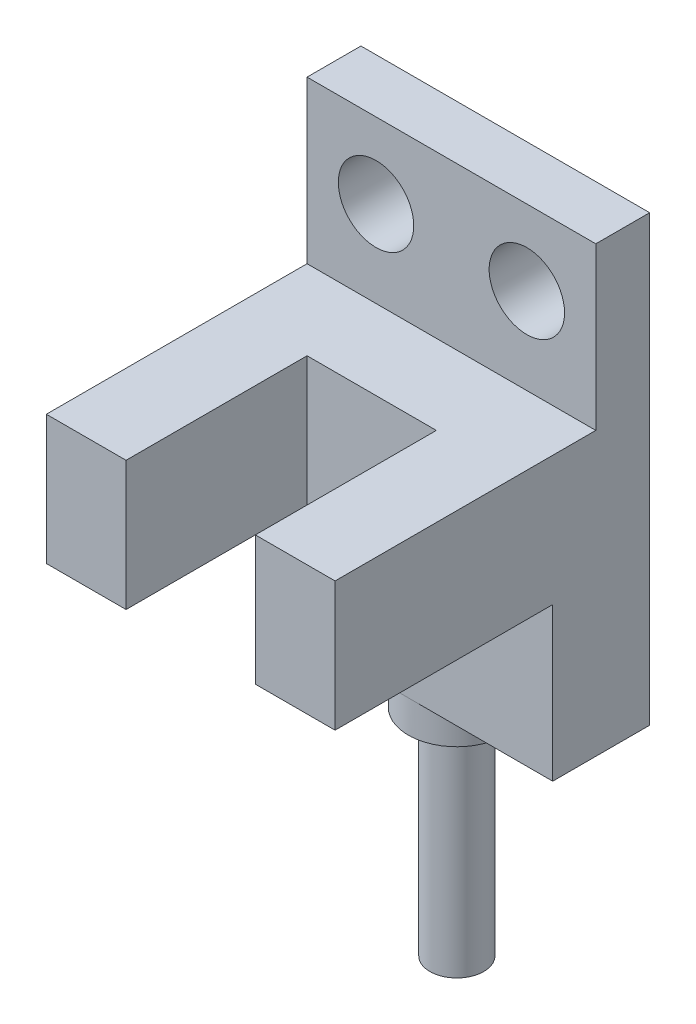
ISO-10303-21;
HEADER;
FILE_DESCRIPTION(('STEP AP214'),'2;1');
FILE_NAME('part.step','',(''),(''),'','','');
FILE_SCHEMA(('AUTOMOTIVE_DESIGN { 1 0 10303 214 1 1 1 1 }'));
ENDSEC;
DATA;
#1=APPLICATION_CONTEXT('core data for automotive mechanical design processes');
#2=APPLICATION_PROTOCOL_DEFINITION('international standard','automotive_design',2000,#1);
#3=PRODUCT_CONTEXT('',#1,'mechanical');
#4=PRODUCT('Part','Part','',(#3));
#5=PRODUCT_RELATED_PRODUCT_CATEGORY('part','',(#4));
#6=PRODUCT_DEFINITION_FORMATION('','',#4);
#7=PRODUCT_DEFINITION_CONTEXT('part definition',#1,'design');
#8=PRODUCT_DEFINITION('design','',#6,#7);
#9=PRODUCT_DEFINITION_SHAPE('','',#8);
#10=(LENGTH_UNIT() NAMED_UNIT(*) SI_UNIT(.MILLI.,.METRE.));
#11=(NAMED_UNIT(*) PLANE_ANGLE_UNIT() SI_UNIT($,.RADIAN.));
#12=(NAMED_UNIT(*) SI_UNIT($,.STERADIAN.) SOLID_ANGLE_UNIT());
#13=UNCERTAINTY_MEASURE_WITH_UNIT(LENGTH_MEASURE(1.E-05),#10,'distance_accuracy_value','');
#14=(GEOMETRIC_REPRESENTATION_CONTEXT(3) GLOBAL_UNCERTAINTY_ASSIGNED_CONTEXT((#13)) GLOBAL_UNIT_ASSIGNED_CONTEXT((#10,
#11,#12)) REPRESENTATION_CONTEXT('',''));
#15=CARTESIAN_POINT('',(0.,0.,0.));
#16=DIRECTION('',(0.,0.,1.));
#17=DIRECTION('',(1.,0.,0.));
#18=AXIS2_PLACEMENT_3D('',#15,#16,#17);
#19=CARTESIAN_POINT('',(13.4,0.,4.5));
#20=DIRECTION('',(0.,1.,0.));
#21=DIRECTION('',(0.,0.,1.));
#22=AXIS2_PLACEMENT_3D('',#19,#20,#21);
#23=PLANE('',#22);
#24=CARTESIAN_POINT('',(6.7,0.,2.25));
#25=DIRECTION('',(0.,-1.,0.));
#26=DIRECTION('',(0.,0.,-1.));
#27=AXIS2_PLACEMENT_3D('',#24,#25,#26);
#28=CIRCLE('',#27,2.25);
#29=CARTESIAN_POINT('',(6.7,0.,0.));
#30=VERTEX_POINT('',#29);
#31=CARTESIAN_POINT('',(6.7,0.,4.5));
#32=VERTEX_POINT('',#31);
#33=EDGE_CURVE('E45',#30,#32,#28,.T.);
#34=ORIENTED_EDGE('',*,*,#33,.F.);
#35=DIRECTION('',(1.,0.,0.));
#36=VECTOR('',#35,1.);
#37=CARTESIAN_POINT('',(13.4,0.,0.));
#38=LINE('',#37,#36);
#39=CARTESIAN_POINT('',(13.4,0.,0.));
#40=VERTEX_POINT('',#39);
#41=EDGE_CURVE('E138',#30,#40,#38,.T.);
#42=ORIENTED_EDGE('',*,*,#41,.T.);
#43=DIRECTION('',(0.,0.,-1.));
#44=VECTOR('',#43,1.);
#45=CARTESIAN_POINT('',(13.4,0.,4.5));
#46=LINE('',#45,#44);
#47=CARTESIAN_POINT('',(13.4,0.,4.5));
#48=VERTEX_POINT('',#47);
#49=EDGE_CURVE('E39',#48,#40,#46,.T.);
#50=ORIENTED_EDGE('',*,*,#49,.F.);
#51=DIRECTION('',(1.,0.,0.));
#52=VECTOR('',#51,1.);
#53=CARTESIAN_POINT('',(13.4,0.,4.5));
#54=LINE('',#53,#52);
#55=EDGE_CURVE('E150',#32,#48,#54,.T.);
#56=ORIENTED_EDGE('',*,*,#55,.F.);
#57=EDGE_LOOP('',(#34,#42,#50,#56));
#58=FACE_BOUND('',#57,.T.);
#59=ADVANCED_FACE('F35',(#58),#23,.F.);
#60=CARTESIAN_POINT('',(0.,0.,4.5));
#61=DIRECTION('',(0.,0.,-1.));
#62=DIRECTION('',(-1.,0.,0.));
#63=AXIS2_PLACEMENT_3D('',#60,#61,#62);
#64=PLANE('',#63);
#65=DIRECTION('',(0.,1.,0.));
#66=VECTOR('',#65,1.);
#67=CARTESIAN_POINT('',(13.4,20.6,4.5));
#68=LINE('',#67,#66);
#69=CARTESIAN_POINT('',(13.4,7.1,4.5));
#70=VERTEX_POINT('',#69);
#71=EDGE_CURVE('E303',#48,#70,#68,.T.);
#72=ORIENTED_EDGE('',*,*,#71,.T.);
#73=DIRECTION('',(1.,0.,0.));
#74=VECTOR('',#73,1.);
#75=CARTESIAN_POINT('',(3.7,7.1,4.5));
#76=LINE('',#75,#74);
#77=CARTESIAN_POINT('',(0.,7.1,4.5));
#78=VERTEX_POINT('',#77);
#79=EDGE_CURVE('E58',#78,#70,#76,.T.);
#80=ORIENTED_EDGE('',*,*,#79,.F.);
#81=DIRECTION('',(0.,-1.,0.));
#82=VECTOR('',#81,1.);
#83=CARTESIAN_POINT('',(0.,0.,4.5));
#84=LINE('',#83,#82);
#85=CARTESIAN_POINT('',(0.,0.,4.5));
#86=VERTEX_POINT('',#85);
#87=EDGE_CURVE('E305',#78,#86,#84,.T.);
#88=ORIENTED_EDGE('',*,*,#87,.T.);
#89=EDGE_CURVE('E301',#86,#32,#54,.T.);
#90=ORIENTED_EDGE('',*,*,#89,.T.);
#91=ORIENTED_EDGE('',*,*,#55,.T.);
#92=EDGE_LOOP('',(#72,#80,#88,#90,#91));
#93=FACE_BOUND('',#92,.T.);
#94=ADVANCED_FACE('F173',(#93),#64,.F.);
#95=CARTESIAN_POINT('',(3.7,13.1,14.6));
#96=DIRECTION('',(-1.,0.,0.));
#97=DIRECTION('',(0.,0.,1.));
#98=AXIS2_PLACEMENT_3D('',#95,#96,#97);
#99=PLANE('',#98);
#100=DIRECTION('',(0.,-1.,0.));
#101=VECTOR('',#100,1.);
#102=CARTESIAN_POINT('',(3.7,7.1,6.2));
#103=LINE('',#102,#101);
#104=CARTESIAN_POINT('',(3.7,13.1,6.2));
#105=VERTEX_POINT('',#104);
#106=CARTESIAN_POINT('',(3.7,7.1,6.2));
#107=VERTEX_POINT('',#106);
#108=EDGE_CURVE('E333',#105,#107,#103,.T.);
#109=ORIENTED_EDGE('',*,*,#108,.F.);
#110=DIRECTION('',(0.,0.,-1.));
#111=VECTOR('',#110,1.);
#112=CARTESIAN_POINT('',(3.7,13.1,14.6));
#113=LINE('',#112,#111);
#114=CARTESIAN_POINT('',(3.7,13.1,14.6));
#115=VERTEX_POINT('',#114);
#116=EDGE_CURVE('E267',#115,#105,#113,.T.);
#117=ORIENTED_EDGE('',*,*,#116,.F.);
#118=DIRECTION('',(0.,1.,0.));
#119=VECTOR('',#118,1.);
#120=CARTESIAN_POINT('',(3.7,13.1,14.6));
#121=LINE('',#120,#119);
#122=CARTESIAN_POINT('',(3.7,7.1,14.6));
#123=VERTEX_POINT('',#122);
#124=EDGE_CURVE('E266',#123,#115,#121,.T.);
#125=ORIENTED_EDGE('',*,*,#124,.F.);
#126=DIRECTION('',(0.,0.,-1.));
#127=VECTOR('',#126,1.);
#128=CARTESIAN_POINT('',(3.7,7.1,14.6));
#129=LINE('',#128,#127);
#130=EDGE_CURVE('E270',#123,#107,#129,.T.);
#131=ORIENTED_EDGE('',*,*,#130,.T.);
#132=EDGE_LOOP('',(#109,#117,#125,#131));
#133=FACE_BOUND('',#132,.T.);
#134=ADVANCED_FACE('F177',(#133),#99,.F.);
#135=CARTESIAN_POINT('',(9.7,13.1,14.6));
#136=DIRECTION('',(1.,0.,0.));
#137=DIRECTION('',(0.,0.,-1.));
#138=AXIS2_PLACEMENT_3D('',#135,#136,#137);
#139=PLANE('',#138);
#140=DIRECTION('',(0.,1.,0.));
#141=VECTOR('',#140,1.);
#142=CARTESIAN_POINT('',(9.7,13.1,6.2));
#143=LINE('',#142,#141);
#144=CARTESIAN_POINT('',(9.7,7.1,6.2));
#145=VERTEX_POINT('',#144);
#146=CARTESIAN_POINT('',(9.7,13.1,6.2));
#147=VERTEX_POINT('',#146);
#148=EDGE_CURVE('E336',#145,#147,#143,.T.);
#149=ORIENTED_EDGE('',*,*,#148,.F.);
#150=DIRECTION('',(0.,0.,-1.));
#151=VECTOR('',#150,1.);
#152=CARTESIAN_POINT('',(9.7,7.1,14.6));
#153=LINE('',#152,#151);
#154=CARTESIAN_POINT('',(9.7,7.1,14.6));
#155=VERTEX_POINT('',#154);
#156=EDGE_CURVE('E251',#155,#145,#153,.T.);
#157=ORIENTED_EDGE('',*,*,#156,.F.);
#158=DIRECTION('',(0.,-1.,0.));
#159=VECTOR('',#158,1.);
#160=CARTESIAN_POINT('',(9.7,13.1,14.6));
#161=LINE('',#160,#159);
#162=CARTESIAN_POINT('',(9.7,13.1,14.6));
#163=VERTEX_POINT('',#162);
#164=EDGE_CURVE('E240',#163,#155,#161,.T.);
#165=ORIENTED_EDGE('',*,*,#164,.F.);
#166=DIRECTION('',(0.,0.,-1.));
#167=VECTOR('',#166,1.);
#168=CARTESIAN_POINT('',(9.7,13.1,14.6));
#169=LINE('',#168,#167);
#170=EDGE_CURVE('E248',#163,#147,#169,.T.);
#171=ORIENTED_EDGE('',*,*,#170,.T.);
#172=EDGE_LOOP('',(#149,#157,#165,#171));
#173=FACE_BOUND('',#172,.T.);
#174=ADVANCED_FACE('F195',(#173),#139,.F.);
#175=CARTESIAN_POINT('',(13.4,20.6,4.5));
#176=DIRECTION('',(-1.,0.,0.));
#177=DIRECTION('',(0.,0.,1.));
#178=AXIS2_PLACEMENT_3D('',#175,#176,#177);
#179=PLANE('',#178);
#180=DIRECTION('',(0.,0.,1.));
#181=VECTOR('',#180,1.);
#182=CARTESIAN_POINT('',(13.4,13.1,2.5));
#183=LINE('',#182,#181);
#184=CARTESIAN_POINT('',(13.4,13.1,2.5));
#185=VERTEX_POINT('',#184);
#186=CARTESIAN_POINT('',(13.4,13.1,14.6));
#187=VERTEX_POINT('',#186);
#188=EDGE_CURVE('E148',#185,#187,#183,.T.);
#189=ORIENTED_EDGE('',*,*,#188,.T.);
#190=DIRECTION('',(0.,1.,0.));
#191=VECTOR('',#190,1.);
#192=CARTESIAN_POINT('',(13.4,13.1,14.6));
#193=LINE('',#192,#191);
#194=CARTESIAN_POINT('',(13.4,7.1,14.6));
#195=VERTEX_POINT('',#194);
#196=EDGE_CURVE('E243',#195,#187,#193,.T.);
#197=ORIENTED_EDGE('',*,*,#196,.F.);
#198=DIRECTION('',(0.,0.,-1.));
#199=VECTOR('',#198,1.);
#200=CARTESIAN_POINT('',(13.4,7.1,14.6));
#201=LINE('',#200,#199);
#202=EDGE_CURVE('E256',#195,#70,#201,.T.);
#203=ORIENTED_EDGE('',*,*,#202,.T.);
#204=ORIENTED_EDGE('',*,*,#71,.F.);
#205=ORIENTED_EDGE('',*,*,#49,.T.);
#206=DIRECTION('',(0.,1.,0.));
#207=VECTOR('',#206,1.);
#208=CARTESIAN_POINT('',(13.4,20.6,0.));
#209=LINE('',#208,#207);
#210=CARTESIAN_POINT('',(13.4,20.6,0.));
#211=VERTEX_POINT('',#210);
#212=EDGE_CURVE('E137',#40,#211,#209,.T.);
#213=ORIENTED_EDGE('',*,*,#212,.T.);
#214=DIRECTION('',(0.,0.,-1.));
#215=VECTOR('',#214,1.);
#216=CARTESIAN_POINT('',(13.4,20.6,4.5));
#217=LINE('',#216,#215);
#218=CARTESIAN_POINT('',(13.4,20.6,2.5));
#219=VERTEX_POINT('',#218);
#220=EDGE_CURVE('E315',#219,#211,#217,.T.);
#221=ORIENTED_EDGE('',*,*,#220,.F.);
#222=DIRECTION('',(0.,-1.,0.));
#223=VECTOR('',#222,1.);
#224=CARTESIAN_POINT('',(13.4,20.6,2.5));
#225=LINE('',#224,#223);
#226=EDGE_CURVE('E293',#219,#185,#225,.T.);
#227=ORIENTED_EDGE('',*,*,#226,.T.);
#228=EDGE_LOOP('',(#189,#197,#203,#204,#205,#213,#221,#227));
#229=FACE_BOUND('',#228,.T.);
#230=ADVANCED_FACE('F189',(#229),#179,.F.);
#231=CARTESIAN_POINT('',(0.,0.,4.5));
#232=DIRECTION('',(1.,0.,0.));
#233=DIRECTION('',(0.,0.,-1.));
#234=AXIS2_PLACEMENT_3D('',#231,#232,#233);
#235=PLANE('',#234);
#236=DIRECTION('',(0.,0.,1.));
#237=VECTOR('',#236,1.);
#238=CARTESIAN_POINT('',(0.,13.1,2.5));
#239=LINE('',#238,#237);
#240=CARTESIAN_POINT('',(0.,13.1,2.5));
#241=VERTEX_POINT('',#240);
#242=CARTESIAN_POINT('',(0.,13.1,14.6));
#243=VERTEX_POINT('',#242);
#244=EDGE_CURVE('E298',#241,#243,#239,.T.);
#245=ORIENTED_EDGE('',*,*,#244,.F.);
#246=DIRECTION('',(0.,1.,0.));
#247=VECTOR('',#246,1.);
#248=CARTESIAN_POINT('',(0.,13.1,2.5));
#249=LINE('',#248,#247);
#250=CARTESIAN_POINT('',(0.,20.6,2.5));
#251=VERTEX_POINT('',#250);
#252=EDGE_CURVE('E285',#241,#251,#249,.T.);
#253=ORIENTED_EDGE('',*,*,#252,.T.);
#254=DIRECTION('',(0.,0.,-1.));
#255=VECTOR('',#254,1.);
#256=CARTESIAN_POINT('',(0.,20.6,4.5));
#257=LINE('',#256,#255);
#258=CARTESIAN_POINT('',(0.,20.6,0.));
#259=VERTEX_POINT('',#258);
#260=EDGE_CURVE('E314',#251,#259,#257,.T.);
#261=ORIENTED_EDGE('',*,*,#260,.T.);
#262=DIRECTION('',(0.,-1.,0.));
#263=VECTOR('',#262,1.);
#264=CARTESIAN_POINT('',(0.,0.,0.));
#265=LINE('',#264,#263);
#266=CARTESIAN_POINT('',(0.,0.,0.));
#267=VERTEX_POINT('',#266);
#268=EDGE_CURVE('E311',#259,#267,#265,.T.);
#269=ORIENTED_EDGE('',*,*,#268,.T.);
#270=DIRECTION('',(0.,0.,-1.));
#271=VECTOR('',#270,1.);
#272=CARTESIAN_POINT('',(0.,0.,4.5));
#273=LINE('',#272,#271);
#274=EDGE_CURVE('E134',#86,#267,#273,.T.);
#275=ORIENTED_EDGE('',*,*,#274,.F.);
#276=ORIENTED_EDGE('',*,*,#87,.F.);
#277=DIRECTION('',(0.,0.,-1.));
#278=VECTOR('',#277,1.);
#279=CARTESIAN_POINT('',(0.,7.1,14.6));
#280=LINE('',#279,#278);
#281=CARTESIAN_POINT('',(0.,7.1,14.6));
#282=VERTEX_POINT('',#281);
#283=EDGE_CURVE('E273',#282,#78,#280,.T.);
#284=ORIENTED_EDGE('',*,*,#283,.F.);
#285=DIRECTION('',(0.,-1.,0.));
#286=VECTOR('',#285,1.);
#287=CARTESIAN_POINT('',(0.,13.1,14.6));
#288=LINE('',#287,#286);
#289=EDGE_CURVE('E262',#243,#282,#288,.T.);
#290=ORIENTED_EDGE('',*,*,#289,.F.);
#291=EDGE_LOOP('',(#245,#253,#261,#269,#275,#276,#284,#290));
#292=FACE_BOUND('',#291,.T.);
#293=ADVANCED_FACE('F182',(#292),#235,.F.);
#294=EDGE_CURVE('E11',#32,#30,#28,.T.);
#295=ORIENTED_EDGE('',*,*,#294,.F.);
#296=ORIENTED_EDGE('',*,*,#89,.F.);
#297=ORIENTED_EDGE('',*,*,#274,.T.);
#298=EDGE_CURVE('E131',#267,#30,#38,.T.);
#299=ORIENTED_EDGE('',*,*,#298,.T.);
#300=EDGE_LOOP('',(#295,#296,#297,#299));
#301=FACE_BOUND('',#300,.T.);
#302=ADVANCED_FACE('F37',(#301),#23,.F.);
#303=CARTESIAN_POINT('',(0.,20.6,4.5));
#304=DIRECTION('',(0.,-1.,0.));
#305=DIRECTION('',(0.,0.,-1.));
#306=AXIS2_PLACEMENT_3D('',#303,#304,#305);
#307=PLANE('',#306);
#308=ORIENTED_EDGE('',*,*,#260,.F.);
#309=DIRECTION('',(1.,0.,0.));
#310=VECTOR('',#309,1.);
#311=CARTESIAN_POINT('',(0.,20.6,2.5));
#312=LINE('',#311,#310);
#313=EDGE_CURVE('E290',#251,#219,#312,.T.);
#314=ORIENTED_EDGE('',*,*,#313,.T.);
#315=ORIENTED_EDGE('',*,*,#220,.T.);
#316=DIRECTION('',(-1.,0.,0.));
#317=VECTOR('',#316,1.);
#318=CARTESIAN_POINT('',(0.,20.6,0.));
#319=LINE('',#318,#317);
#320=EDGE_CURVE('E308',#211,#259,#319,.T.);
#321=ORIENTED_EDGE('',*,*,#320,.T.);
#322=EDGE_LOOP('',(#308,#314,#315,#321));
#323=FACE_BOUND('',#322,.T.);
#324=ADVANCED_FACE('F181',(#323),#307,.F.);
#325=CARTESIAN_POINT('',(0.,0.,0.));
#326=DIRECTION('',(0.,0.,-1.));
#327=DIRECTION('',(-1.,0.,0.));
#328=AXIS2_PLACEMENT_3D('',#325,#326,#327);
#329=PLANE('',#328);
#330=CARTESIAN_POINT('',(10.2,17.1,0.));
#331=DIRECTION('',(0.,0.,1.));
#332=DIRECTION('',(1.,0.,0.));
#333=AXIS2_PLACEMENT_3D('',#330,#331,#332);
#334=CIRCLE('',#333,1.75);
#335=CARTESIAN_POINT('',(11.95,17.1,0.));
#336=VERTEX_POINT('',#335);
#337=EDGE_CURVE('E276',#336,#336,#334,.T.);
#338=ORIENTED_EDGE('',*,*,#337,.T.);
#339=EDGE_LOOP('',(#338));
#340=FACE_BOUND('',#339,.T.);
#341=CARTESIAN_POINT('',(3.2,17.1,0.));
#342=DIRECTION('',(0.,0.,1.));
#343=DIRECTION('',(1.,0.,0.));
#344=AXIS2_PLACEMENT_3D('',#341,#342,#343);
#345=CIRCLE('',#344,1.75);
#346=CARTESIAN_POINT('',(4.95,17.1,0.));
#347=VERTEX_POINT('',#346);
#348=EDGE_CURVE('E282',#347,#347,#345,.T.);
#349=ORIENTED_EDGE('',*,*,#348,.T.);
#350=EDGE_LOOP('',(#349));
#351=FACE_BOUND('',#350,.T.);
#352=ORIENTED_EDGE('',*,*,#298,.F.);
#353=ORIENTED_EDGE('',*,*,#268,.F.);
#354=ORIENTED_EDGE('',*,*,#320,.F.);
#355=ORIENTED_EDGE('',*,*,#212,.F.);
#356=ORIENTED_EDGE('',*,*,#41,.F.);
#357=EDGE_LOOP('',(#352,#353,#354,#355,#356));
#358=FACE_BOUND('',#357,.T.);
#359=ADVANCED_FACE('F142',(#340,#351,#358),#329,.T.);
#360=CARTESIAN_POINT('',(13.4,13.1,2.5));
#361=DIRECTION('',(0.,1.,0.));
#362=DIRECTION('',(0.,0.,1.));
#363=AXIS2_PLACEMENT_3D('',#360,#361,#362);
#364=PLANE('',#363);
#365=ORIENTED_EDGE('',*,*,#116,.T.);
#366=DIRECTION('',(-1.,0.,0.));
#367=VECTOR('',#366,1.);
#368=CARTESIAN_POINT('',(3.7,13.1,6.2));
#369=LINE('',#368,#367);
#370=EDGE_CURVE('E244',#147,#105,#369,.T.);
#371=ORIENTED_EDGE('',*,*,#370,.F.);
#372=ORIENTED_EDGE('',*,*,#170,.F.);
#373=DIRECTION('',(-1.,0.,0.));
#374=VECTOR('',#373,1.);
#375=CARTESIAN_POINT('',(13.4,13.1,14.6));
#376=LINE('',#375,#374);
#377=EDGE_CURVE('E238',#187,#163,#376,.T.);
#378=ORIENTED_EDGE('',*,*,#377,.F.);
#379=ORIENTED_EDGE('',*,*,#188,.F.);
#380=DIRECTION('',(-1.,0.,0.));
#381=VECTOR('',#380,1.);
#382=CARTESIAN_POINT('',(13.4,13.1,2.5));
#383=LINE('',#382,#381);
#384=EDGE_CURVE('E296',#185,#241,#383,.T.);
#385=ORIENTED_EDGE('',*,*,#384,.T.);
#386=ORIENTED_EDGE('',*,*,#244,.T.);
#387=DIRECTION('',(-1.,0.,0.));
#388=VECTOR('',#387,1.);
#389=CARTESIAN_POINT('',(0.,13.1,14.6));
#390=LINE('',#389,#388);
#391=EDGE_CURVE('E253',#115,#243,#390,.T.);
#392=ORIENTED_EDGE('',*,*,#391,.F.);
#393=EDGE_LOOP('',(#365,#371,#372,#378,#379,#385,#386,#392));
#394=FACE_BOUND('',#393,.T.);
#395=ADVANCED_FACE('F200',(#394),#364,.T.);
#396=CARTESIAN_POINT('',(0.,0.,2.5));
#397=DIRECTION('',(0.,0.,-1.));
#398=DIRECTION('',(-1.,0.,0.));
#399=AXIS2_PLACEMENT_3D('',#396,#397,#398);
#400=PLANE('',#399);
#401=CARTESIAN_POINT('',(10.2,17.1,2.5));
#402=DIRECTION('',(0.,0.,1.));
#403=DIRECTION('',(1.,0.,0.));
#404=AXIS2_PLACEMENT_3D('',#401,#402,#403);
#405=CIRCLE('',#404,1.75);
#406=CARTESIAN_POINT('',(11.95,17.1,2.5));
#407=VERTEX_POINT('',#406);
#408=EDGE_CURVE('E275',#407,#407,#405,.T.);
#409=ORIENTED_EDGE('',*,*,#408,.F.);
#410=EDGE_LOOP('',(#409));
#411=FACE_BOUND('',#410,.T.);
#412=CARTESIAN_POINT('',(3.2,17.1,2.5));
#413=DIRECTION('',(0.,0.,1.));
#414=DIRECTION('',(1.,0.,0.));
#415=AXIS2_PLACEMENT_3D('',#412,#413,#414);
#416=CIRCLE('',#415,1.75);
#417=CARTESIAN_POINT('',(4.95,17.1,2.5));
#418=VERTEX_POINT('',#417);
#419=EDGE_CURVE('E279',#418,#418,#416,.T.);
#420=ORIENTED_EDGE('',*,*,#419,.F.);
#421=EDGE_LOOP('',(#420));
#422=FACE_BOUND('',#421,.T.);
#423=ORIENTED_EDGE('',*,*,#252,.F.);
#424=ORIENTED_EDGE('',*,*,#384,.F.);
#425=ORIENTED_EDGE('',*,*,#226,.F.);
#426=ORIENTED_EDGE('',*,*,#313,.F.);
#427=EDGE_LOOP('',(#423,#424,#425,#426));
#428=FACE_BOUND('',#427,.T.);
#429=ADVANCED_FACE('F205',(#411,#422,#428),#400,.F.);
#430=CARTESIAN_POINT('',(3.2,17.1,0.));
#431=DIRECTION('',(0.,0.,1.));
#432=DIRECTION('',(1.,0.,0.));
#433=AXIS2_PLACEMENT_3D('',#430,#431,#432);
#434=CYLINDRICAL_SURFACE('',#433,1.75);
#435=ORIENTED_EDGE('',*,*,#348,.F.);
#436=EDGE_LOOP('',(#435));
#437=FACE_BOUND('',#436,.T.);
#438=ORIENTED_EDGE('',*,*,#419,.T.);
#439=EDGE_LOOP('',(#438));
#440=FACE_BOUND('',#439,.T.);
#441=ADVANCED_FACE('F209',(#437,#440),#434,.F.);
#442=CARTESIAN_POINT('',(10.2,17.1,0.));
#443=DIRECTION('',(0.,0.,1.));
#444=DIRECTION('',(1.,0.,0.));
#445=AXIS2_PLACEMENT_3D('',#442,#443,#444);
#446=CYLINDRICAL_SURFACE('',#445,1.75);
#447=ORIENTED_EDGE('',*,*,#337,.F.);
#448=EDGE_LOOP('',(#447));
#449=FACE_BOUND('',#448,.T.);
#450=ORIENTED_EDGE('',*,*,#408,.T.);
#451=EDGE_LOOP('',(#450));
#452=FACE_BOUND('',#451,.T.);
#453=ADVANCED_FACE('F213',(#449,#452),#446,.F.);
#454=CARTESIAN_POINT('',(3.7,7.1,14.6));
#455=DIRECTION('',(0.,1.,0.));
#456=DIRECTION('',(0.,0.,1.));
#457=AXIS2_PLACEMENT_3D('',#454,#455,#456);
#458=PLANE('',#457);
#459=ORIENTED_EDGE('',*,*,#79,.T.);
#460=ORIENTED_EDGE('',*,*,#202,.F.);
#461=DIRECTION('',(1.,0.,0.));
#462=VECTOR('',#461,1.);
#463=CARTESIAN_POINT('',(9.7,7.1,14.6));
#464=LINE('',#463,#462);
#465=EDGE_CURVE('E344',#155,#195,#464,.T.);
#466=ORIENTED_EDGE('',*,*,#465,.F.);
#467=ORIENTED_EDGE('',*,*,#156,.T.);
#468=DIRECTION('',(1.,0.,0.));
#469=VECTOR('',#468,1.);
#470=CARTESIAN_POINT('',(9.7,7.1,6.2));
#471=LINE('',#470,#469);
#472=EDGE_CURVE('E334',#107,#145,#471,.T.);
#473=ORIENTED_EDGE('',*,*,#472,.F.);
#474=ORIENTED_EDGE('',*,*,#130,.F.);
#475=DIRECTION('',(1.,0.,0.));
#476=VECTOR('',#475,1.);
#477=CARTESIAN_POINT('',(3.7,7.1,14.6));
#478=LINE('',#477,#476);
#479=EDGE_CURVE('E264',#282,#123,#478,.T.);
#480=ORIENTED_EDGE('',*,*,#479,.F.);
#481=ORIENTED_EDGE('',*,*,#283,.T.);
#482=EDGE_LOOP('',(#459,#460,#466,#467,#473,#474,#480,#481));
#483=FACE_BOUND('',#482,.T.);
#484=ADVANCED_FACE('F217',(#483),#458,.F.);
#485=CARTESIAN_POINT('',(0.,0.,14.6));
#486=DIRECTION('',(0.,0.,-1.));
#487=DIRECTION('',(-1.,0.,0.));
#488=AXIS2_PLACEMENT_3D('',#485,#486,#487);
#489=PLANE('',#488);
#490=ORIENTED_EDGE('',*,*,#391,.T.);
#491=ORIENTED_EDGE('',*,*,#289,.T.);
#492=ORIENTED_EDGE('',*,*,#479,.T.);
#493=ORIENTED_EDGE('',*,*,#124,.T.);
#494=EDGE_LOOP('',(#490,#491,#492,#493));
#495=FACE_BOUND('',#494,.T.);
#496=ADVANCED_FACE('F221',(#495),#489,.F.);
#497=CARTESIAN_POINT('',(0.,0.,14.6));
#498=DIRECTION('',(0.,0.,1.));
#499=DIRECTION('',(1.,0.,0.));
#500=AXIS2_PLACEMENT_3D('',#497,#498,#499);
#501=PLANE('',#500);
#502=ORIENTED_EDGE('',*,*,#377,.T.);
#503=ORIENTED_EDGE('',*,*,#164,.T.);
#504=ORIENTED_EDGE('',*,*,#465,.T.);
#505=ORIENTED_EDGE('',*,*,#196,.T.);
#506=EDGE_LOOP('',(#502,#503,#504,#505));
#507=FACE_BOUND('',#506,.T.);
#508=ADVANCED_FACE('F168',(#507),#501,.T.);
#509=CARTESIAN_POINT('',(0.,0.,6.2));
#510=DIRECTION('',(0.,0.,-1.));
#511=DIRECTION('',(-1.,0.,0.));
#512=AXIS2_PLACEMENT_3D('',#509,#510,#511);
#513=PLANE('',#512);
#514=ORIENTED_EDGE('',*,*,#108,.T.);
#515=ORIENTED_EDGE('',*,*,#472,.T.);
#516=ORIENTED_EDGE('',*,*,#148,.T.);
#517=ORIENTED_EDGE('',*,*,#370,.T.);
#518=EDGE_LOOP('',(#514,#515,#516,#517));
#519=FACE_BOUND('',#518,.T.);
#520=ADVANCED_FACE('F158',(#519),#513,.F.);
#521=CARTESIAN_POINT('',(6.7,-1.5,2.25));
#522=DIRECTION('',(0.,1.,0.));
#523=DIRECTION('',(0.,0.,1.));
#524=AXIS2_PLACEMENT_3D('',#521,#522,#523);
#525=CYLINDRICAL_SURFACE('',#524,2.25);
#526=CARTESIAN_POINT('',(6.7,-1.5,2.25));
#527=DIRECTION('',(0.,-1.,0.));
#528=DIRECTION('',(0.,0.,-1.));
#529=AXIS2_PLACEMENT_3D('',#526,#527,#528);
#530=CIRCLE('',#529,2.25);
#531=CARTESIAN_POINT('',(6.7,-1.5,0.));
#532=VERTEX_POINT('',#531);
#533=EDGE_CURVE('E153',#532,#532,#530,.T.);
#534=ORIENTED_EDGE('',*,*,#533,.F.);
#535=EDGE_LOOP('',(#534));
#536=FACE_BOUND('',#535,.T.);
#537=ORIENTED_EDGE('',*,*,#33,.T.);
#538=ORIENTED_EDGE('',*,*,#294,.T.);
#539=EDGE_LOOP('',(#537,#538));
#540=FACE_BOUND('',#539,.T.);
#541=ADVANCED_FACE('F155',(#536,#540),#525,.T.);
#542=CARTESIAN_POINT('',(6.7,-1.5,2.25));
#543=DIRECTION('',(0.,-1.,0.));
#544=DIRECTION('',(0.,0.,-1.));
#545=AXIS2_PLACEMENT_3D('',#542,#543,#544);
#546=PLANE('',#545);
#547=CARTESIAN_POINT('',(6.7,-1.5,2.25));
#548=DIRECTION('',(0.,-1.,0.));
#549=DIRECTION('',(0.,0.,-1.));
#550=AXIS2_PLACEMENT_3D('',#547,#548,#549);
#551=CIRCLE('',#550,1.25);
#552=CARTESIAN_POINT('',(6.7,-1.5,1.));
#553=VERTEX_POINT('',#552);
#554=EDGE_CURVE('E348',#553,#553,#551,.T.);
#555=ORIENTED_EDGE('',*,*,#554,.F.);
#556=EDGE_LOOP('',(#555));
#557=FACE_BOUND('',#556,.T.);
#558=ORIENTED_EDGE('',*,*,#533,.T.);
#559=EDGE_LOOP('',(#558));
#560=FACE_BOUND('',#559,.T.);
#561=ADVANCED_FACE('F157',(#557,#560),#546,.T.);
#562=CARTESIAN_POINT('',(6.7,-11.5,2.25));
#563=DIRECTION('',(0.,1.,0.));
#564=DIRECTION('',(0.,0.,1.));
#565=AXIS2_PLACEMENT_3D('',#562,#563,#564);
#566=CYLINDRICAL_SURFACE('',#565,1.25);
#567=CARTESIAN_POINT('',(6.7,-11.5,2.25));
#568=DIRECTION('',(0.,-1.,0.));
#569=DIRECTION('',(0.,0.,-1.));
#570=AXIS2_PLACEMENT_3D('',#567,#568,#569);
#571=CIRCLE('',#570,1.25);
#572=CARTESIAN_POINT('',(6.7,-11.5,1.));
#573=VERTEX_POINT('',#572);
#574=EDGE_CURVE('E154',#573,#573,#571,.T.);
#575=ORIENTED_EDGE('',*,*,#574,.F.);
#576=EDGE_LOOP('',(#575));
#577=FACE_BOUND('',#576,.T.);
#578=ORIENTED_EDGE('',*,*,#554,.T.);
#579=EDGE_LOOP('',(#578));
#580=FACE_BOUND('',#579,.T.);
#581=ADVANCED_FACE('F165',(#577,#580),#566,.T.);
#582=CARTESIAN_POINT('',(6.7,-11.5,2.25));
#583=DIRECTION('',(0.,-1.,0.));
#584=DIRECTION('',(0.,0.,-1.));
#585=AXIS2_PLACEMENT_3D('',#582,#583,#584);
#586=PLANE('',#585);
#587=ORIENTED_EDGE('',*,*,#574,.T.);
#588=EDGE_LOOP('',(#587));
#589=FACE_BOUND('',#588,.T.);
#590=ADVANCED_FACE('F354',(#589),#586,.T.);
#591=CLOSED_SHELL('',(#59,#94,#134,#174,#230,#293,#302,#324,#359,#395,#429,#441,#453,#484,#496,
#508,#520,#541,#561,#581,#590));
#592=MANIFOLD_SOLID_BREP('B2',#591);
#593=ADVANCED_BREP_SHAPE_REPRESENTATION('',(#18,#592),#14);
#594=SHAPE_DEFINITION_REPRESENTATION(#9,#593);
ENDSEC;
END-ISO-10303-21;
